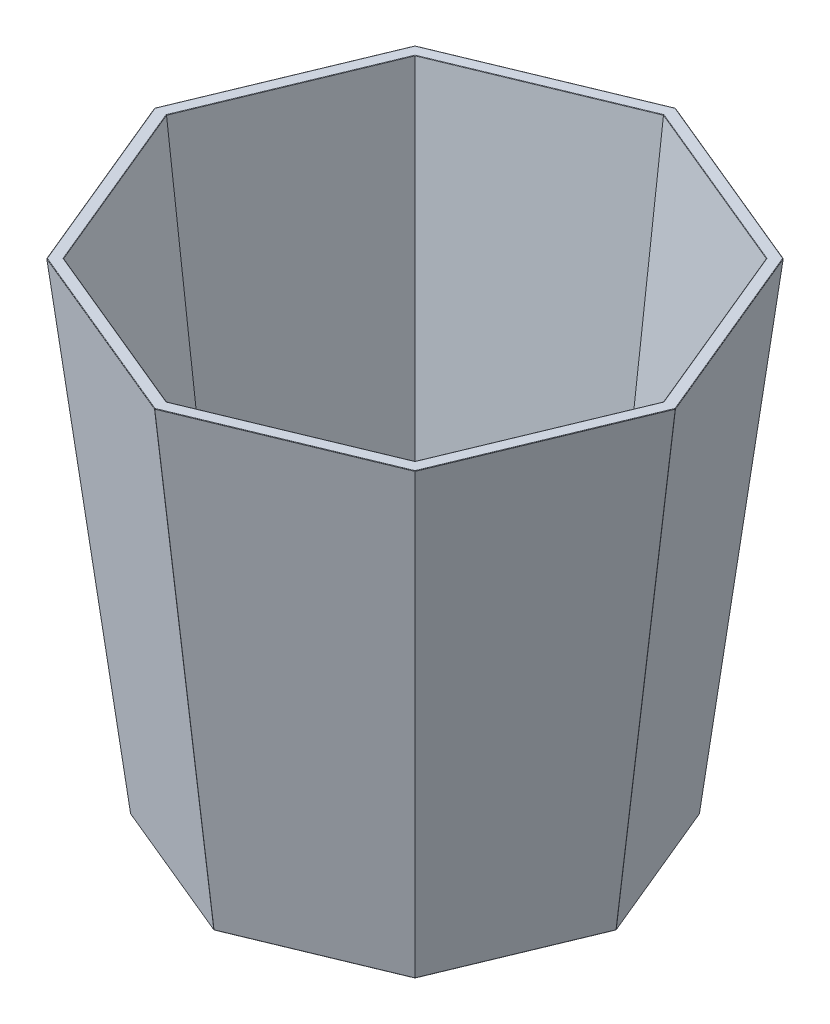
from build123d import *

# Parameters (mm, degrees)
BOSS_EXTRUDE1_DEPTH = 110
BOSS_EXTRUDE1_DRAFT = -6.5
SHELL1_T            = -2.5
SKETCH3_R           = 30
CUT_EXTRUDE1_DEPTH  = 110
FILLET3_R           = 0.1


with BuildPart() as part:
    # Sketch1 → Boss-Extrude1 (with draft: the straight prism first)
    with BuildSketch(Plane(origin=(0, 0, 0), x_dir=(1, 0, 0), z_dir=(0, 1, 0))):
        Polygon((0, -59.531571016), (42.09517756, -42.09517756), (59.531571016, 0), (42.09517756, 42.09517756), (0, 59.531571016), (-42.09517756, 42.09517756), (-59.531571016, 0), (-42.09517756, -42.09517756), align=None)
    extrude(amount=-BOSS_EXTRUDE1_DEPTH)
    # Boss-Extrude1: the draft: its side faces are tilted about the plane it starts from
    boss_extrude1_sides = [part.faces().sort_by_distance(p)[0] for p in [
        (21.04758878, -55, 50.813374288),
        (50.813374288, -55, 21.04758878),
        (50.813374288, -55, -21.04758878),
        (21.04758878, -55, -50.813374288),
        (-21.04758878, -55, -50.813374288),
        (-50.813374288, -55, -21.04758878),
        (-50.813374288, -55, 21.04758878),
        (-21.04758878, -55, 50.813374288),
    ]]
    draft(boss_extrude1_sides, Plane(origin=(0, 0, 0), x_dir=(1, 0, 0), z_dir=(0, 1, 0)), BOSS_EXTRUDE1_DRAFT)

    # Shell1
    shell1_openings = [part.faces().sort_by_distance(p)[0] for p in [
        (0, 0, 0),
    ]]
    offset(amount=SHELL1_T, openings=shell1_openings, kind=Kind.INTERSECTION)

    # Sketch3 → Cut-Extrude1 (cut)
    with BuildSketch(Plane(origin=(0, -107.5, 0), x_dir=(1, 0, 0), z_dir=(0, 1, 0))):
        with Locations(Location((0, 0, 0), (0, 0, 270))):
            Circle(SKETCH3_R)
    extrude(amount=-CUT_EXTRUDE1_DEPTH, mode=Mode.SUBTRACT)

    # Fillet3
    fillet3_edges = [part.edges().sort_by_distance(p)[0] for p in [
        (16.251449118, -110, -39.234468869),
        (50.813374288, 0, -21.04758878),
        (50.813374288, 0, 21.04758878),
        (-16.251449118, -110, -39.234468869),
        (37.299037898, -55, 37.299037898),
        (0, -55, 52.748805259),
        (-37.299037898, -55, 37.299037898),
        (-52.748805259, -55, 0),
        (-37.299037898, -55, -37.299037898),
        (0, -55, -52.748805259),
        (37.299037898, -55, -37.299037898),
        (52.748805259, -55, 0),
        (-39.234468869, -110, -16.251449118),
        (-39.234468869, -110, 16.251449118),
        (-16.251449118, -110, 39.234468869),
        (16.251449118, -110, 39.234468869),
        (48.488732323, 0, 20.08469055),
        (48.488732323, 0, -20.08469055),
        (20.08469055, 0, -48.488732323),
        (-20.08469055, 0, -48.488732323),
        (-48.488732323, 0, -20.08469055),
        (-48.488732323, 0, 20.08469055),
        (-20.08469055, 0, 48.488732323),
        (20.08469055, 0, 48.488732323),
        (39.234468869, -110, 16.251449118),
        (0, -110, -30),
        (39.234468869, -110, -16.251449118),
        (21.04758878, 0, 50.813374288),
        (-21.04758878, 0, 50.813374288),
        (-50.813374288, 0, 21.04758878),
        (-50.813374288, 0, -21.04758878),
        (-21.04758878, 0, -50.813374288),
        (21.04758878, 0, -50.813374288),
    ]]
    fillet(fillet3_edges, radius=FILLET3_R)


solid = part.part
